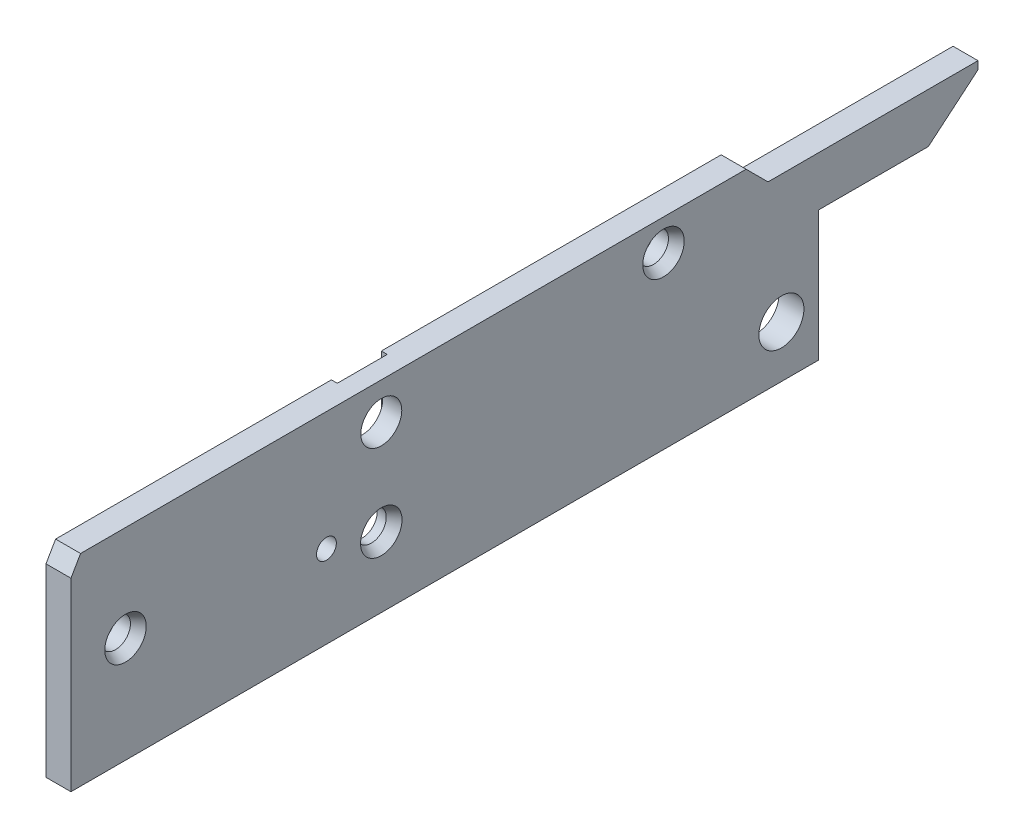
from build123d import *
from OCP.BRepFilletAPI import BRepFilletAPI_MakeChamfer

# Parameters (mm, degrees)
SKETCH_1_R          = 3.57505
SKETCH_1_R_2        = 2.3749
SKETCH_1_R_3        = 3.2512
SKETCH_1_R_4        = 1.5748
EXTRUDE_1_DEPTH     = 3.9624
SKETCH_2_W          = 7.9248
SKETCH_2_H          = 32.004
CUT_EXTRUDE_1_DEPTH = 0.9398
CHAMFER_1_SIZE      = 1.5875
CHAMFER_1_SIZE2     = 0.916543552
CHAMFER_2_SIZE      = 1.190625
CHAMFER_2_SIZE2     = 0.687407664


with BuildPart() as part:
    # Sketch 1 → Extrude 1 (new body)
    with BuildSketch(Plane(origin=(0, 0, 0), x_dir=(0, 0, -1), z_dir=(1, 0, 0))):
        Polygon((-112.8014, -8.2042), (5.9182, -8.2042), (5.9182, 12.446), (23.328373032, 12.446), (31.2166, 19.06500834), (31.2166, 20.32), (-2.1209, 20.32), (-5.6007, 23.7998), (-111.2774, 23.7998), (-112.8014, 21.160154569), align=None)
        Circle(SKETCH_1_R, mode=Mode.SUBTRACT)
        with Locations((-63.5254, 2.921)):
            Circle(SKETCH_1_R_2, mode=Mode.SUBTRACT)
        with Locations((-63.5254, 17.9832)):
            Circle(SKETCH_1_R_3, mode=Mode.SUBTRACT)
        with Locations((-72.2376, 4.9276)):
            Circle(SKETCH_1_R_4, mode=Mode.SUBTRACT)
        with Locations((-104.14, 8.5852)):
            Circle(SKETCH_1_R_2, mode=Mode.SUBTRACT)
        with Locations((-18.7198, 18.8468)):
            Circle(SKETCH_1_R_2, mode=Mode.SUBTRACT)
    extrude(amount=EXTRUDE_1_DEPTH)

    # Sketch 2 → Cut-Extrude 1 (cut)
    with BuildSketch(Plane(origin=(0, 0, 0), x_dir=(0, 0, -1), z_dir=(1, 0, 0))):
        with Locations((-63.5254, 7.7978)):
            Rectangle(SKETCH_2_W, SKETCH_2_H)
    extrude(amount=CUT_EXTRUDE_1_DEPTH, mode=Mode.SUBTRACT)

    # Chamfer 1: one chamfer whose edges measure the first distance from different faces: ONE call of the kernel's chamfer builder (chamfer() names one face for all edges)
    chamfer_1_edges_1 = [part.edges().sort_by_distance(p)[0] for p in [
        (3.9624, 2.921, 65.9003),
    ]]
    chamfer_1_side_1 = [part.faces().sort_by_distance(p)[0] for p in [
        (2.4511, 2.921, 65.9003),
    ]]
    chamfer_1_edges_2 = [part.edges().sort_by_distance(p)[0] for p in [
        (3.9624, 8.5852, 106.5149),
    ]]
    chamfer_1_side_2 = [part.faces().sort_by_distance(p)[0] for p in [
        (1.9812, 8.5852, 106.5149),
    ]]
    chamfer_1_edges_3 = [part.edges().sort_by_distance(p)[0] for p in [
        (3.9624, 18.8468, 21.0947),
    ]]
    chamfer_1_side_3 = [part.faces().sort_by_distance(p)[0] for p in [
        (1.9812, 18.8468, 21.0947),
    ]]
    chamfer_1 = BRepFilletAPI_MakeChamfer(part.part.solid().wrapped)
    for e in chamfer_1_edges_1:
        chamfer_1.Add(CHAMFER_1_SIZE, CHAMFER_1_SIZE2, e.wrapped, chamfer_1_side_1[0].wrapped)  # the first distance lies on this face
    for e in chamfer_1_edges_2:
        chamfer_1.Add(CHAMFER_1_SIZE, CHAMFER_1_SIZE2, e.wrapped, chamfer_1_side_2[0].wrapped)  # the first distance lies on this face
    for e in chamfer_1_edges_3:
        chamfer_1.Add(CHAMFER_1_SIZE, CHAMFER_1_SIZE2, e.wrapped, chamfer_1_side_3[0].wrapped)  # the first distance lies on this face
    add(Compound.cast(chamfer_1.Shape()), mode=Mode.REPLACE)

    # Chamfer 2
    chamfer_2_edges = [part.edges().sort_by_distance(p)[0] for p in [
        (0, 4.9276, 73.8124),
    ]]
    chamfer_2_side = [part.faces().sort_by_distance(p)[0] for p in [
        (1.9812, 4.9276, 73.8124),
    ]]
    chamfer(chamfer_2_edges, length=CHAMFER_2_SIZE, length2=CHAMFER_2_SIZE2, reference=chamfer_2_side[0])


solid = part.part
